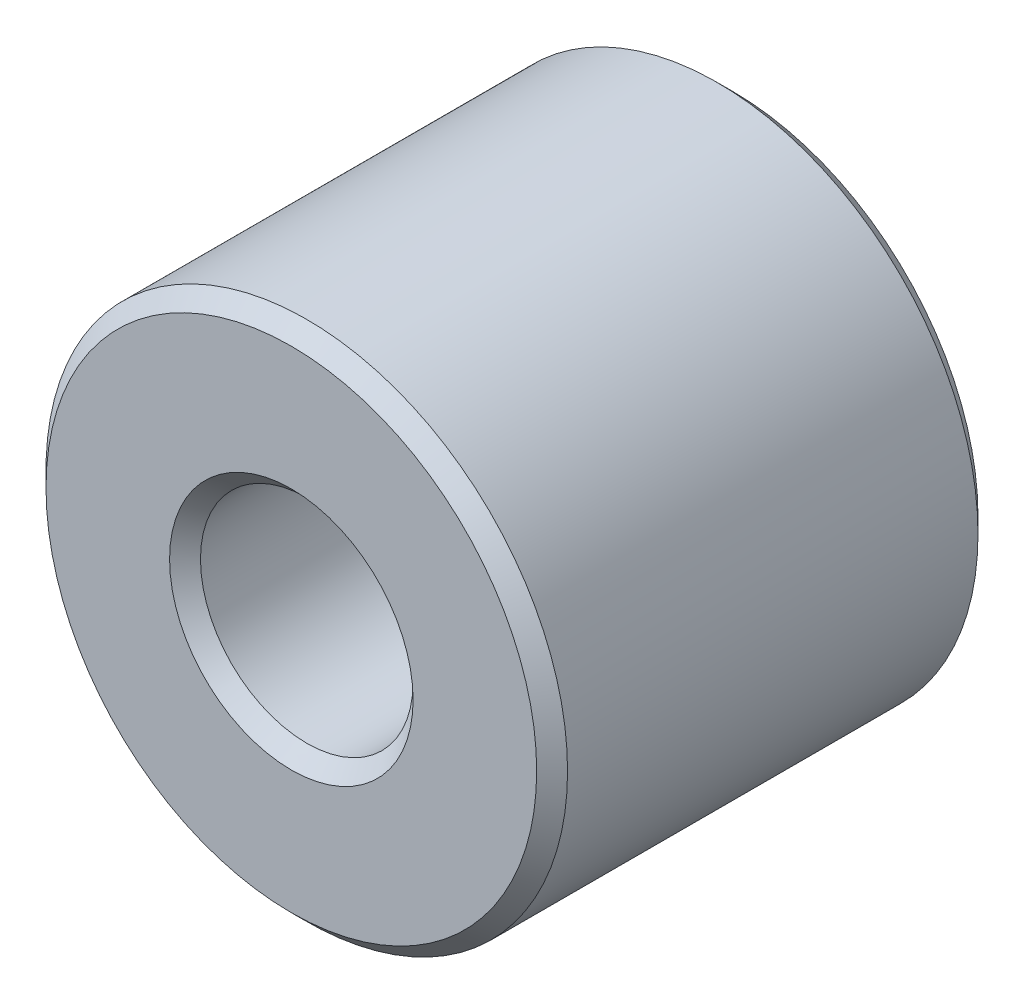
ISO-10303-21;
HEADER;
FILE_DESCRIPTION(('STEP AP214'),'2;1');
FILE_NAME('part.step','',(''),(''),'','','');
FILE_SCHEMA(('AUTOMOTIVE_DESIGN { 1 0 10303 214 1 1 1 1 }'));
ENDSEC;
DATA;
#1=APPLICATION_CONTEXT('core data for automotive mechanical design processes');
#2=APPLICATION_PROTOCOL_DEFINITION('international standard','automotive_design',2000,#1);
#3=PRODUCT_CONTEXT('',#1,'mechanical');
#4=PRODUCT('Part','Part','',(#3));
#5=PRODUCT_RELATED_PRODUCT_CATEGORY('part','',(#4));
#6=PRODUCT_DEFINITION_FORMATION('','',#4);
#7=PRODUCT_DEFINITION_CONTEXT('part definition',#1,'design');
#8=PRODUCT_DEFINITION('design','',#6,#7);
#9=PRODUCT_DEFINITION_SHAPE('','',#8);
#10=(LENGTH_UNIT() NAMED_UNIT(*) SI_UNIT(.MILLI.,.METRE.));
#11=(NAMED_UNIT(*) PLANE_ANGLE_UNIT() SI_UNIT($,.RADIAN.));
#12=(NAMED_UNIT(*) SI_UNIT($,.STERADIAN.) SOLID_ANGLE_UNIT());
#13=UNCERTAINTY_MEASURE_WITH_UNIT(LENGTH_MEASURE(1.E-05),#10,'distance_accuracy_value','');
#14=(GEOMETRIC_REPRESENTATION_CONTEXT(3) GLOBAL_UNCERTAINTY_ASSIGNED_CONTEXT((#13)) GLOBAL_UNIT_ASSIGNED_CONTEXT((#10,
#11,#12)) REPRESENTATION_CONTEXT('',''));
#15=CARTESIAN_POINT('',(0.,0.,0.));
#16=DIRECTION('',(0.,0.,1.));
#17=DIRECTION('',(1.,0.,0.));
#18=AXIS2_PLACEMENT_3D('',#15,#16,#17);
#19=CARTESIAN_POINT('',(0.,0.,-5.5));
#20=DIRECTION('',(0.,0.,1.));
#21=DIRECTION('',(1.,0.,0.));
#22=AXIS2_PLACEMENT_3D('',#19,#20,#21);
#23=CYLINDRICAL_SURFACE('',#22,6.5);
#24=CARTESIAN_POINT('',(0.,0.,5.115));
#25=DIRECTION('',(0.,0.,1.));
#26=DIRECTION('',(1.,0.,0.));
#27=AXIS2_PLACEMENT_3D('',#24,#25,#26);
#28=CIRCLE('',#27,6.5);
#29=CARTESIAN_POINT('',(6.5,0.,5.115));
#30=VERTEX_POINT('',#29);
#31=EDGE_CURVE('E60',#30,#30,#28,.F.);
#32=ORIENTED_EDGE('',*,*,#31,.T.);
#33=EDGE_LOOP('',(#32));
#34=FACE_BOUND('',#33,.T.);
#35=CARTESIAN_POINT('',(0.,0.,-5.115));
#36=DIRECTION('',(0.,0.,1.));
#37=DIRECTION('',(1.,0.,0.));
#38=AXIS2_PLACEMENT_3D('',#35,#36,#37);
#39=CIRCLE('',#38,6.5);
#40=CARTESIAN_POINT('',(6.5,0.,-5.115));
#41=VERTEX_POINT('',#40);
#42=EDGE_CURVE('E64',#41,#41,#39,.T.);
#43=ORIENTED_EDGE('',*,*,#42,.T.);
#44=EDGE_LOOP('',(#43));
#45=FACE_BOUND('',#44,.T.);
#46=ADVANCED_FACE('F34',(#34,#45),#23,.T.);
#47=CARTESIAN_POINT('',(0.,0.,-5.5));
#48=DIRECTION('',(0.,0.,1.));
#49=DIRECTION('',(1.,0.,0.));
#50=AXIS2_PLACEMENT_3D('',#47,#48,#49);
#51=PLANE('',#50);
#52=CARTESIAN_POINT('',(0.,0.,-5.5));
#53=DIRECTION('',(0.,0.,1.));
#54=DIRECTION('',(1.,0.,0.));
#55=AXIS2_PLACEMENT_3D('',#52,#53,#54);
#56=CIRCLE('',#55,6.115);
#57=CARTESIAN_POINT('',(6.115,0.,-5.5));
#58=VERTEX_POINT('',#57);
#59=EDGE_CURVE('E48',#58,#58,#56,.F.);
#60=ORIENTED_EDGE('',*,*,#59,.T.);
#61=EDGE_LOOP('',(#60));
#62=FACE_BOUND('',#61,.T.);
#63=CARTESIAN_POINT('',(0.,0.,-5.5));
#64=DIRECTION('',(0.,0.,1.));
#65=DIRECTION('',(1.,0.,0.));
#66=AXIS2_PLACEMENT_3D('',#63,#64,#65);
#67=CIRCLE('',#66,3.035);
#68=CARTESIAN_POINT('',(3.035,0.,-5.5));
#69=VERTEX_POINT('',#68);
#70=EDGE_CURVE('E54',#69,#69,#67,.T.);
#71=ORIENTED_EDGE('',*,*,#70,.T.);
#72=EDGE_LOOP('',(#71));
#73=FACE_BOUND('',#72,.T.);
#74=ADVANCED_FACE('F93',(#62,#73),#51,.F.);
#75=CARTESIAN_POINT('',(0.,0.,-5.5));
#76=DIRECTION('',(0.,0.,1.));
#77=DIRECTION('',(1.,0.,0.));
#78=AXIS2_PLACEMENT_3D('',#75,#76,#77);
#79=CYLINDRICAL_SURFACE('',#78,2.65);
#80=CARTESIAN_POINT('',(0.,0.,5.11499999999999));
#81=DIRECTION('',(0.,0.,1.));
#82=DIRECTION('',(1.,0.,0.));
#83=AXIS2_PLACEMENT_3D('',#80,#81,#82);
#84=CIRCLE('',#83,2.65);
#85=CARTESIAN_POINT('',(2.65,0.,5.11499999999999));
#86=VERTEX_POINT('',#85);
#87=EDGE_CURVE('E10',#86,#86,#84,.T.);
#88=ORIENTED_EDGE('',*,*,#87,.T.);
#89=EDGE_LOOP('',(#88));
#90=FACE_BOUND('',#89,.T.);
#91=CARTESIAN_POINT('',(0.,0.,-5.115));
#92=DIRECTION('',(0.,0.,1.));
#93=DIRECTION('',(1.,0.,0.));
#94=AXIS2_PLACEMENT_3D('',#91,#92,#93);
#95=CIRCLE('',#94,2.65);
#96=CARTESIAN_POINT('',(2.65,0.,-5.115));
#97=VERTEX_POINT('',#96);
#98=EDGE_CURVE('E42',#97,#97,#95,.F.);
#99=ORIENTED_EDGE('',*,*,#98,.T.);
#100=EDGE_LOOP('',(#99));
#101=FACE_BOUND('',#100,.T.);
#102=ADVANCED_FACE('F99',(#90,#101),#79,.F.);
#103=CARTESIAN_POINT('',(0.,0.,5.5));
#104=DIRECTION('',(0.,0.,1.));
#105=DIRECTION('',(1.,0.,0.));
#106=AXIS2_PLACEMENT_3D('',#103,#104,#105);
#107=PLANE('',#106);
#108=CARTESIAN_POINT('',(0.,0.,5.5));
#109=DIRECTION('',(0.,0.,1.));
#110=DIRECTION('',(1.,0.,0.));
#111=AXIS2_PLACEMENT_3D('',#108,#109,#110);
#112=CIRCLE('',#111,6.115);
#113=CARTESIAN_POINT('',(6.115,0.,5.5));
#114=VERTEX_POINT('',#113);
#115=EDGE_CURVE('E68',#114,#114,#112,.T.);
#116=ORIENTED_EDGE('',*,*,#115,.T.);
#117=EDGE_LOOP('',(#116));
#118=FACE_BOUND('',#117,.T.);
#119=CARTESIAN_POINT('',(0.,0.,5.5));
#120=DIRECTION('',(0.,0.,1.));
#121=DIRECTION('',(1.,0.,0.));
#122=AXIS2_PLACEMENT_3D('',#119,#120,#121);
#123=CIRCLE('',#122,3.03500000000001);
#124=CARTESIAN_POINT('',(3.03500000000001,0.,5.5));
#125=VERTEX_POINT('',#124);
#126=EDGE_CURVE('E72',#125,#125,#123,.F.);
#127=ORIENTED_EDGE('',*,*,#126,.T.);
#128=EDGE_LOOP('',(#127));
#129=FACE_BOUND('',#128,.T.);
#130=ADVANCED_FACE('F78',(#118,#129),#107,.T.);
#131=CARTESIAN_POINT('',(0.,0.,5.5));
#132=DIRECTION('',(0.,0.,-1.));
#133=DIRECTION('',(-1.,0.,0.));
#134=AXIS2_PLACEMENT_3D('',#131,#132,#133);
#135=CONICAL_SURFACE('',#134,6.115,0.785398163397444);
#136=ORIENTED_EDGE('',*,*,#31,.F.);
#137=EDGE_LOOP('',(#136));
#138=FACE_BOUND('',#137,.T.);
#139=ORIENTED_EDGE('',*,*,#115,.F.);
#140=EDGE_LOOP('',(#139));
#141=FACE_BOUND('',#140,.T.);
#142=ADVANCED_FACE('F89',(#138,#141),#135,.T.);
#143=CARTESIAN_POINT('',(0.,0.,-5.115));
#144=DIRECTION('',(0.,0.,1.));
#145=DIRECTION('',(1.,0.,0.));
#146=AXIS2_PLACEMENT_3D('',#143,#144,#145);
#147=CONICAL_SURFACE('',#146,6.5,0.785398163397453);
#148=ORIENTED_EDGE('',*,*,#59,.F.);
#149=EDGE_LOOP('',(#148));
#150=FACE_BOUND('',#149,.T.);
#151=ORIENTED_EDGE('',*,*,#42,.F.);
#152=EDGE_LOOP('',(#151));
#153=FACE_BOUND('',#152,.T.);
#154=ADVANCED_FACE('F83',(#150,#153),#147,.T.);
#155=CARTESIAN_POINT('',(0.,0.,5.11499999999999));
#156=DIRECTION('',(0.,0.,1.));
#157=DIRECTION('',(1.,0.,0.));
#158=AXIS2_PLACEMENT_3D('',#155,#156,#157);
#159=CONICAL_SURFACE('',#158,2.65,0.785398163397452);
#160=ORIENTED_EDGE('',*,*,#126,.F.);
#161=EDGE_LOOP('',(#160));
#162=FACE_BOUND('',#161,.T.);
#163=ORIENTED_EDGE('',*,*,#87,.F.);
#164=EDGE_LOOP('',(#163));
#165=FACE_BOUND('',#164,.T.);
#166=ADVANCED_FACE('F80',(#162,#165),#159,.F.);
#167=CARTESIAN_POINT('',(0.,0.,-5.5));
#168=DIRECTION('',(0.,0.,-1.));
#169=DIRECTION('',(-1.,0.,0.));
#170=AXIS2_PLACEMENT_3D('',#167,#168,#169);
#171=CONICAL_SURFACE('',#170,3.035,0.785398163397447);
#172=ORIENTED_EDGE('',*,*,#98,.F.);
#173=EDGE_LOOP('',(#172));
#174=FACE_BOUND('',#173,.T.);
#175=ORIENTED_EDGE('',*,*,#70,.F.);
#176=EDGE_LOOP('',(#175));
#177=FACE_BOUND('',#176,.T.);
#178=ADVANCED_FACE('F36',(#174,#177),#171,.F.);
#179=CLOSED_SHELL('',(#46,#74,#102,#130,#142,#154,#166,#178));
#180=MANIFOLD_SOLID_BREP('B2',#179);
#181=ADVANCED_BREP_SHAPE_REPRESENTATION('',(#18,#180),#14);
#182=SHAPE_DEFINITION_REPRESENTATION(#9,#181);
ENDSEC;
END-ISO-10303-21;
